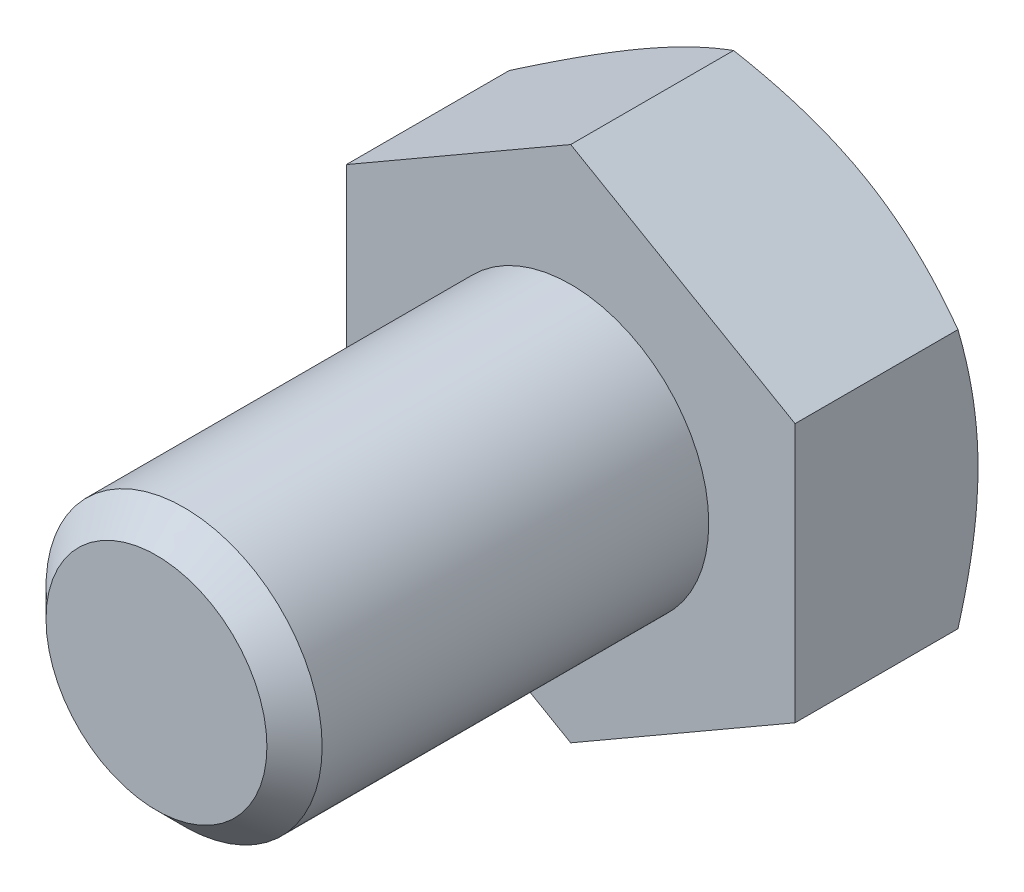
from build123d import *

# Parameters (mm, degrees)
ESQUISSE1_W        = 4
ESQUISSE1_H        = 12
CHANFREIN1_SIZE    = 0.8
BOSS_EXTRU_1_DEPTH = 5.3


with BuildPart() as part:
    # Esquisse1 → Base-R_volution (revolve)
    with BuildSketch(Plane(origin=(0, 0, 0), x_dir=(1, 0, 0), z_dir=(0, 1, 0))):
        with Locations((2, -6)):
            Rectangle(ESQUISSE1_W, ESQUISSE1_H)
    revolve(axis=Axis((0, 0, 0), (0, 0, 1)))

    # Chanfrein1
    chanfrein1_edges = [part.edges().sort_by_distance(p)[0] for p in [
        (-4, 0, 12),
    ]]
    chamfer(chanfrein1_edges, length=CHANFREIN1_SIZE)

    # Esquisse6 → Boss.-Extru.1 (add)
    with BuildSketch(Plane.XY):
        Polygon((6.5, -3.75277675), (6.5, 3.75277675), (0, 7.505553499), (-6.5, 3.75277675), (-6.5, -3.75277675), (0, -7.505553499), align=None)
    extrude(amount=-BOSS_EXTRU_1_DEPTH)

    # Esquisse7 → Enl_vement de mati_re-R_volution1 (revolve, cut)
    with BuildSketch(Plane(origin=(0, 0, 0), x_dir=(1, 0, 0), z_dir=(0, 1, 0))):
        Polygon((-6.5, 5.3), (-15.67986928, 5.3), (-15.67986928, 0), align=None)
    revolve(axis=Axis((0, 0, -6.239446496), (0, 0, 1)), mode=Mode.SUBTRACT)


solid = part.part
